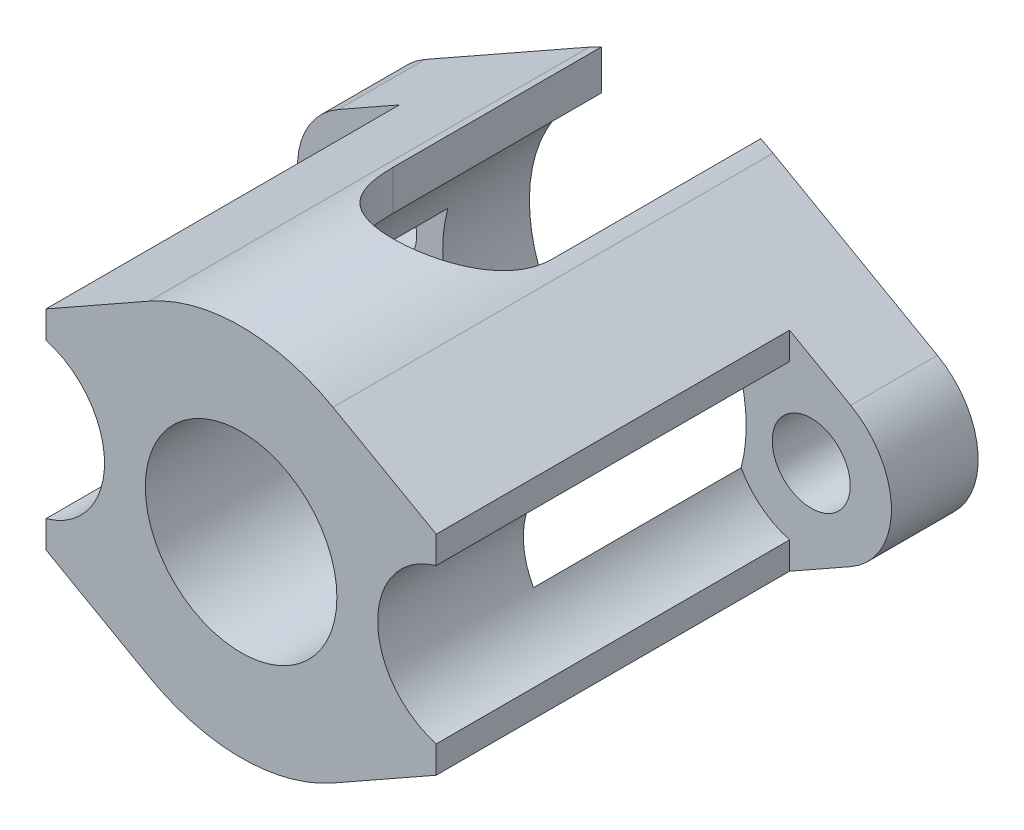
ISO-10303-21;
HEADER;
FILE_DESCRIPTION(('STEP AP214'),'2;1');
FILE_NAME('part.step','',(''),(''),'','','');
FILE_SCHEMA(('AUTOMOTIVE_DESIGN { 1 0 10303 214 1 1 1 1 }'));
ENDSEC;
DATA;
#1=APPLICATION_CONTEXT('core data for automotive mechanical design processes');
#2=APPLICATION_PROTOCOL_DEFINITION('international standard','automotive_design',2000,#1);
#3=PRODUCT_CONTEXT('',#1,'mechanical');
#4=PRODUCT('Part','Part','',(#3));
#5=PRODUCT_RELATED_PRODUCT_CATEGORY('part','',(#4));
#6=PRODUCT_DEFINITION_FORMATION('','',#4);
#7=PRODUCT_DEFINITION_CONTEXT('part definition',#1,'design');
#8=PRODUCT_DEFINITION('design','',#6,#7);
#9=PRODUCT_DEFINITION_SHAPE('','',#8);
#10=(LENGTH_UNIT() NAMED_UNIT(*) SI_UNIT(.MILLI.,.METRE.));
#11=(NAMED_UNIT(*) PLANE_ANGLE_UNIT() SI_UNIT($,.RADIAN.));
#12=(NAMED_UNIT(*) SI_UNIT($,.STERADIAN.) SOLID_ANGLE_UNIT());
#13=UNCERTAINTY_MEASURE_WITH_UNIT(LENGTH_MEASURE(1.E-05),#10,'distance_accuracy_value','');
#14=(GEOMETRIC_REPRESENTATION_CONTEXT(3) GLOBAL_UNCERTAINTY_ASSIGNED_CONTEXT((#13)) GLOBAL_UNIT_ASSIGNED_CONTEXT((#10,
#11,#12)) REPRESENTATION_CONTEXT('',''));
#15=CARTESIAN_POINT('',(0.,0.,0.));
#16=DIRECTION('',(0.,0.,1.));
#17=DIRECTION('',(1.,0.,0.));
#18=AXIS2_PLACEMENT_3D('',#15,#16,#17);
#19=CARTESIAN_POINT('',(12.7,0.,25.781));
#20=DIRECTION('',(0.,0.,-1.));
#21=DIRECTION('',(-1.,0.,0.));
#22=AXIS2_PLACEMENT_3D('',#19,#20,#21);
#23=CYLINDRICAL_SURFACE('',#22,4.699);
#24=CARTESIAN_POINT('',(12.7,0.,5.08));
#25=DIRECTION('',(0.,0.,1.));
#26=DIRECTION('',(1.,0.,0.));
#27=AXIS2_PLACEMENT_3D('',#24,#25,#26);
#28=CIRCLE('',#27,4.699);
#29=CARTESIAN_POINT('',(15.011908,-4.09092683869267,5.08));
#30=VERTEX_POINT('',#29);
#31=CARTESIAN_POINT('',(15.011908,4.09092683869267,5.08));
#32=VERTEX_POINT('',#31);
#33=EDGE_CURVE('E262',#30,#32,#28,.T.);
#34=ORIENTED_EDGE('',*,*,#33,.F.);
#35=DIRECTION('',(0.,0.,-1.));
#36=VECTOR('',#35,1.);
#37=CARTESIAN_POINT('',(15.011908,-4.09092683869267,25.781));
#38=LINE('',#37,#36);
#39=CARTESIAN_POINT('',(15.011908,-4.09092683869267,0.));
#40=VERTEX_POINT('',#39);
#41=EDGE_CURVE('E417',#30,#40,#38,.T.);
#42=ORIENTED_EDGE('',*,*,#41,.T.);
#43=CARTESIAN_POINT('',(12.7,0.,0.));
#44=DIRECTION('',(0.,0.,1.));
#45=DIRECTION('',(1.,0.,0.));
#46=AXIS2_PLACEMENT_3D('',#43,#44,#45);
#47=CIRCLE('',#46,4.699);
#48=CARTESIAN_POINT('',(15.011908,4.09092683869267,0.));
#49=VERTEX_POINT('',#48);
#50=EDGE_CURVE('E483',#40,#49,#47,.T.);
#51=ORIENTED_EDGE('',*,*,#50,.T.);
#52=DIRECTION('',(0.,0.,-1.));
#53=VECTOR('',#52,1.);
#54=CARTESIAN_POINT('',(15.011908,4.09092683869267,25.781));
#55=LINE('',#54,#53);
#56=EDGE_CURVE('E419',#32,#49,#55,.T.);
#57=ORIENTED_EDGE('',*,*,#56,.F.);
#58=EDGE_LOOP('',(#34,#42,#51,#57));
#59=FACE_BOUND('',#58,.T.);
#60=ADVANCED_FACE('F38',(#59),#23,.T.);
#61=CARTESIAN_POINT('',(12.7,0.,25.781));
#62=DIRECTION('',(0.,0.,-1.));
#63=DIRECTION('',(-1.,0.,0.));
#64=AXIS2_PLACEMENT_3D('',#61,#62,#63);
#65=CYLINDRICAL_SURFACE('',#64,2.286);
#66=CARTESIAN_POINT('',(12.7,0.,0.));
#67=DIRECTION('',(0.,0.,1.));
#68=DIRECTION('',(1.,0.,0.));
#69=AXIS2_PLACEMENT_3D('',#66,#67,#68);
#70=CIRCLE('',#69,2.286);
#71=CARTESIAN_POINT('',(14.986,0.,0.));
#72=VERTEX_POINT('',#71);
#73=EDGE_CURVE('E508',#72,#72,#70,.T.);
#74=ORIENTED_EDGE('',*,*,#73,.F.);
#75=EDGE_LOOP('',(#74));
#76=FACE_BOUND('',#75,.T.);
#77=CARTESIAN_POINT('',(12.7,0.,5.08));
#78=DIRECTION('',(0.,0.,1.));
#79=DIRECTION('',(1.,0.,0.));
#80=AXIS2_PLACEMENT_3D('',#77,#78,#79);
#81=CIRCLE('',#80,2.286);
#82=CARTESIAN_POINT('',(14.986,0.,5.08));
#83=VERTEX_POINT('',#82);
#84=EDGE_CURVE('E257',#83,#83,#81,.T.);
#85=ORIENTED_EDGE('',*,*,#84,.T.);
#86=EDGE_LOOP('',(#85));
#87=FACE_BOUND('',#86,.T.);
#88=ADVANCED_FACE('F391',(#76,#87),#65,.F.);
#89=CARTESIAN_POINT('',(-12.7,0.,25.781));
#90=DIRECTION('',(0.,0.,-1.));
#91=DIRECTION('',(-1.,0.,0.));
#92=AXIS2_PLACEMENT_3D('',#89,#90,#91);
#93=CYLINDRICAL_SURFACE('',#92,4.699);
#94=CARTESIAN_POINT('',(-12.7,0.,5.08));
#95=DIRECTION('',(0.,0.,1.));
#96=DIRECTION('',(1.,0.,0.));
#97=AXIS2_PLACEMENT_3D('',#94,#95,#96);
#98=CIRCLE('',#97,4.699);
#99=CARTESIAN_POINT('',(-15.011908,4.09092683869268,5.08));
#100=VERTEX_POINT('',#99);
#101=CARTESIAN_POINT('',(-15.011908,-4.09092683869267,5.08));
#102=VERTEX_POINT('',#101);
#103=EDGE_CURVE('E298',#100,#102,#98,.T.);
#104=ORIENTED_EDGE('',*,*,#103,.F.);
#105=DIRECTION('',(0.,0.,-1.));
#106=VECTOR('',#105,1.);
#107=CARTESIAN_POINT('',(-15.011908,4.09092683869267,25.781));
#108=LINE('',#107,#106);
#109=CARTESIAN_POINT('',(-15.011908,4.09092683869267,0.));
#110=VERTEX_POINT('',#109);
#111=EDGE_CURVE('E440',#100,#110,#108,.T.);
#112=ORIENTED_EDGE('',*,*,#111,.T.);
#113=CARTESIAN_POINT('',(-12.7,0.,0.));
#114=DIRECTION('',(0.,0.,1.));
#115=DIRECTION('',(-1.,0.,0.));
#116=AXIS2_PLACEMENT_3D('',#113,#114,#115);
#117=CIRCLE('',#116,4.699);
#118=CARTESIAN_POINT('',(-15.011908,-4.09092683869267,0.));
#119=VERTEX_POINT('',#118);
#120=EDGE_CURVE('E488',#110,#119,#117,.T.);
#121=ORIENTED_EDGE('',*,*,#120,.T.);
#122=DIRECTION('',(0.,0.,-1.));
#123=VECTOR('',#122,1.);
#124=CARTESIAN_POINT('',(-15.011908,-4.09092683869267,25.781));
#125=LINE('',#124,#123);
#126=EDGE_CURVE('E438',#102,#119,#125,.T.);
#127=ORIENTED_EDGE('',*,*,#126,.F.);
#128=EDGE_LOOP('',(#104,#112,#121,#127));
#129=FACE_BOUND('',#128,.T.);
#130=ADVANCED_FACE('F385',(#129),#93,.T.);
#131=CARTESIAN_POINT('',(-12.7,0.,25.781));
#132=DIRECTION('',(0.,0.,-1.));
#133=DIRECTION('',(-1.,0.,0.));
#134=AXIS2_PLACEMENT_3D('',#131,#132,#133);
#135=CYLINDRICAL_SURFACE('',#134,2.286);
#136=CARTESIAN_POINT('',(-12.7,0.,0.));
#137=DIRECTION('',(0.,0.,1.));
#138=DIRECTION('',(-1.,0.,0.));
#139=AXIS2_PLACEMENT_3D('',#136,#137,#138);
#140=CIRCLE('',#139,2.286);
#141=CARTESIAN_POINT('',(-14.986,0.,0.));
#142=VERTEX_POINT('',#141);
#143=EDGE_CURVE('E452',#142,#142,#140,.T.);
#144=ORIENTED_EDGE('',*,*,#143,.F.);
#145=EDGE_LOOP('',(#144));
#146=FACE_BOUND('',#145,.T.);
#147=CARTESIAN_POINT('',(-12.7,0.,5.08));
#148=DIRECTION('',(0.,0.,1.));
#149=DIRECTION('',(1.,0.,0.));
#150=AXIS2_PLACEMENT_3D('',#147,#148,#149);
#151=CIRCLE('',#150,2.286);
#152=CARTESIAN_POINT('',(-10.414,0.,5.08));
#153=VERTEX_POINT('',#152);
#154=EDGE_CURVE('E293',#153,#153,#151,.T.);
#155=ORIENTED_EDGE('',*,*,#154,.T.);
#156=EDGE_LOOP('',(#155));
#157=FACE_BOUND('',#156,.T.);
#158=ADVANCED_FACE('F380',(#146,#157),#135,.F.);
#159=CARTESIAN_POINT('',(12.7,0.,0.));
#160=DIRECTION('',(0.,0.,1.));
#161=DIRECTION('',(1.,0.,0.));
#162=AXIS2_PLACEMENT_3D('',#159,#160,#161);
#163=PLANE('',#162);
#164=ORIENTED_EDGE('',*,*,#73,.T.);
#165=EDGE_LOOP('',(#164));
#166=FACE_BOUND('',#165,.T.);
#167=CARTESIAN_POINT('',(0.,0.,0.));
#168=DIRECTION('',(0.,0.,1.));
#169=DIRECTION('',(-1.,0.,0.));
#170=AXIS2_PLACEMENT_3D('',#167,#168,#169);
#171=CIRCLE('',#170,10.9474);
#172=CARTESIAN_POINT('',(4.6609,-9.90563364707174,0.));
#173=VERTEX_POINT('',#172);
#174=CARTESIAN_POINT('',(5.3861208,-9.53075387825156,0.));
#175=VERTEX_POINT('',#174);
#176=EDGE_CURVE('E492',#173,#175,#171,.T.);
#177=ORIENTED_EDGE('',*,*,#176,.F.);
#178=DIRECTION('',(0.,1.,0.));
#179=VECTOR('',#178,1.);
#180=CARTESIAN_POINT('',(4.6609,-10.9474,0.));
#181=LINE('',#180,#179);
#182=CARTESIAN_POINT('',(4.6609,-7.57021209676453,0.));
#183=VERTEX_POINT('',#182);
#184=EDGE_CURVE('E306',#173,#183,#181,.T.);
#185=ORIENTED_EDGE('',*,*,#184,.T.);
#186=CARTESIAN_POINT('',(0.,0.,0.));
#187=DIRECTION('',(0.,0.,-1.));
#188=DIRECTION('',(-1.,0.,0.));
#189=AXIS2_PLACEMENT_3D('',#186,#187,#188);
#190=CIRCLE('',#189,8.89);
#191=CARTESIAN_POINT('',(4.6609,7.57021209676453,0.));
#192=VERTEX_POINT('',#191);
#193=EDGE_CURVE('E527',#192,#183,#190,.T.);
#194=ORIENTED_EDGE('',*,*,#193,.F.);
#195=CARTESIAN_POINT('',(4.6609,9.90563364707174,0.));
#196=VERTEX_POINT('',#195);
#197=EDGE_CURVE('E303',#192,#196,#181,.T.);
#198=ORIENTED_EDGE('',*,*,#197,.T.);
#199=CARTESIAN_POINT('',(0.,0.,0.));
#200=DIRECTION('',(0.,0.,1.));
#201=DIRECTION('',(1.,0.,0.));
#202=AXIS2_PLACEMENT_3D('',#199,#200,#201);
#203=CIRCLE('',#202,10.9474);
#204=CARTESIAN_POINT('',(5.3861208,9.53075387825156,0.));
#205=VERTEX_POINT('',#204);
#206=EDGE_CURVE('E479',#205,#196,#203,.T.);
#207=ORIENTED_EDGE('',*,*,#206,.F.);
#208=DIRECTION('',(-0.870595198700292,0.491999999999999,0.));
#209=VECTOR('',#208,1.);
#210=CARTESIAN_POINT('',(5.3861208,9.53075387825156,0.));
#211=LINE('',#210,#209);
#212=EDGE_CURVE('E480',#49,#205,#211,.T.);
#213=ORIENTED_EDGE('',*,*,#212,.F.);
#214=ORIENTED_EDGE('',*,*,#50,.F.);
#215=DIRECTION('',(0.870595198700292,0.491999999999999,0.));
#216=VECTOR('',#215,1.);
#217=CARTESIAN_POINT('',(5.3861208,-9.53075387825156,0.));
#218=LINE('',#217,#216);
#219=EDGE_CURVE('E424',#175,#40,#218,.T.);
#220=ORIENTED_EDGE('',*,*,#219,.F.);
#221=EDGE_LOOP('',(#177,#185,#194,#198,#207,#213,#214,#220));
#222=FACE_BOUND('',#221,.T.);
#223=ADVANCED_FACE('F384',(#166,#222),#163,.F.);
#224=CARTESIAN_POINT('',(0.,0.,25.781));
#225=DIRECTION('',(0.,0.,-1.));
#226=DIRECTION('',(-1.,0.,0.));
#227=AXIS2_PLACEMENT_3D('',#224,#225,#226);
#228=CYLINDRICAL_SURFACE('',#227,5.6134);
#229=CARTESIAN_POINT('',(0.,0.,25.781));
#230=DIRECTION('',(0.,0.,1.));
#231=DIRECTION('',(1.,0.,0.));
#232=AXIS2_PLACEMENT_3D('',#229,#230,#231);
#233=CIRCLE('',#232,5.6134);
#234=CARTESIAN_POINT('',(5.6134,0.,25.781));
#235=VERTEX_POINT('',#234);
#236=EDGE_CURVE('E510',#235,#235,#233,.T.);
#237=ORIENTED_EDGE('',*,*,#236,.T.);
#238=EDGE_LOOP('',(#237));
#239=FACE_BOUND('',#238,.T.);
#240=CARTESIAN_POINT('',(0.,0.,17.2466));
#241=DIRECTION('',(0.,0.,-1.));
#242=DIRECTION('',(-1.,0.,0.));
#243=AXIS2_PLACEMENT_3D('',#240,#241,#242);
#244=CIRCLE('',#243,5.6134);
#245=CARTESIAN_POINT('',(-5.6134,0.,17.2466));
#246=VERTEX_POINT('',#245);
#247=EDGE_CURVE('E450',#246,#246,#244,.T.);
#248=ORIENTED_EDGE('',*,*,#247,.T.);
#249=EDGE_LOOP('',(#248));
#250=FACE_BOUND('',#249,.T.);
#251=ADVANCED_FACE('F387',(#239,#250),#228,.F.);
#252=CARTESIAN_POINT('',(12.7,0.,25.781));
#253=DIRECTION('',(0.,0.,1.));
#254=DIRECTION('',(1.,0.,0.));
#255=AXIS2_PLACEMENT_3D('',#252,#253,#254);
#256=PLANE('',#255);
#257=DIRECTION('',(0.,-1.,0.));
#258=VECTOR('',#257,1.);
#259=CARTESIAN_POINT('',(11.43,-9.35955574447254,25.781));
#260=LINE('',#259,#258);
#261=CARTESIAN_POINT('',(11.43,-4.52412433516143,25.781));
#262=VERTEX_POINT('',#261);
#263=CARTESIAN_POINT('',(11.43,-6.11517270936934,25.781));
#264=VERTEX_POINT('',#263);
#265=EDGE_CURVE('E241',#262,#264,#260,.T.);
#266=ORIENTED_EDGE('',*,*,#265,.F.);
#267=CARTESIAN_POINT('',(12.7,0.,25.781));
#268=DIRECTION('',(0.,0.,1.));
#269=DIRECTION('',(-1.,0.,0.));
#270=AXIS2_PLACEMENT_3D('',#267,#268,#269);
#271=CIRCLE('',#270,4.69899999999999);
#272=CARTESIAN_POINT('',(11.43,4.52412433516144,25.781));
#273=VERTEX_POINT('',#272);
#274=EDGE_CURVE('E232',#273,#262,#271,.T.);
#275=ORIENTED_EDGE('',*,*,#274,.F.);
#276=DIRECTION('',(0.,-1.,0.));
#277=VECTOR('',#276,1.);
#278=CARTESIAN_POINT('',(11.43,4.52412433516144,25.781));
#279=LINE('',#278,#277);
#280=CARTESIAN_POINT('',(11.43,6.11517270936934,25.781));
#281=VERTEX_POINT('',#280);
#282=EDGE_CURVE('E223',#281,#273,#279,.T.);
#283=ORIENTED_EDGE('',*,*,#282,.F.);
#284=DIRECTION('',(-0.870595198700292,0.491999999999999,0.));
#285=VECTOR('',#284,1.);
#286=CARTESIAN_POINT('',(5.3861208,9.53075387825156,25.781));
#287=LINE('',#286,#285);
#288=CARTESIAN_POINT('',(5.3861208,9.53075387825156,25.781));
#289=VERTEX_POINT('',#288);
#290=EDGE_CURVE('E496',#281,#289,#287,.T.);
#291=ORIENTED_EDGE('',*,*,#290,.T.);
#292=CARTESIAN_POINT('',(0.,0.,25.781));
#293=DIRECTION('',(0.,0.,1.));
#294=DIRECTION('',(1.,0.,0.));
#295=AXIS2_PLACEMENT_3D('',#292,#293,#294);
#296=CIRCLE('',#295,10.9474);
#297=CARTESIAN_POINT('',(-5.3861208,9.53075387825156,25.781));
#298=VERTEX_POINT('',#297);
#299=EDGE_CURVE('E519',#289,#298,#296,.T.);
#300=ORIENTED_EDGE('',*,*,#299,.T.);
#301=DIRECTION('',(-0.870595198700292,-0.491999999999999,0.));
#302=VECTOR('',#301,1.);
#303=CARTESIAN_POINT('',(-5.3861208,9.53075387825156,25.781));
#304=LINE('',#303,#302);
#305=CARTESIAN_POINT('',(-11.43,6.11517270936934,25.781));
#306=VERTEX_POINT('',#305);
#307=EDGE_CURVE('E516',#298,#306,#304,.T.);
#308=ORIENTED_EDGE('',*,*,#307,.T.);
#309=DIRECTION('',(0.,1.,0.));
#310=VECTOR('',#309,1.);
#311=CARTESIAN_POINT('',(-11.43,4.52412433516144,25.781));
#312=LINE('',#311,#310);
#313=CARTESIAN_POINT('',(-11.43,4.52412433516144,25.781));
#314=VERTEX_POINT('',#313);
#315=EDGE_CURVE('E278',#314,#306,#312,.T.);
#316=ORIENTED_EDGE('',*,*,#315,.F.);
#317=CARTESIAN_POINT('',(-12.7,0.,25.781));
#318=DIRECTION('',(0.,0.,1.));
#319=DIRECTION('',(1.,0.,0.));
#320=AXIS2_PLACEMENT_3D('',#317,#318,#319);
#321=CIRCLE('',#320,4.69899999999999);
#322=CARTESIAN_POINT('',(-11.43,-4.52412433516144,25.781));
#323=VERTEX_POINT('',#322);
#324=EDGE_CURVE('E266',#323,#314,#321,.T.);
#325=ORIENTED_EDGE('',*,*,#324,.F.);
#326=DIRECTION('',(0.,1.,0.));
#327=VECTOR('',#326,1.);
#328=CARTESIAN_POINT('',(-11.43,-9.35955574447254,25.781));
#329=LINE('',#328,#327);
#330=CARTESIAN_POINT('',(-11.43,-6.11517270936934,25.781));
#331=VERTEX_POINT('',#330);
#332=EDGE_CURVE('E280',#331,#323,#329,.T.);
#333=ORIENTED_EDGE('',*,*,#332,.F.);
#334=DIRECTION('',(0.870595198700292,-0.491999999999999,0.));
#335=VECTOR('',#334,1.);
#336=CARTESIAN_POINT('',(-5.38612079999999,-9.53075387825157,25.781));
#337=LINE('',#336,#335);
#338=CARTESIAN_POINT('',(-5.38612079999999,-9.53075387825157,25.781));
#339=VERTEX_POINT('',#338);
#340=EDGE_CURVE('E514',#331,#339,#337,.T.);
#341=ORIENTED_EDGE('',*,*,#340,.T.);
#342=CARTESIAN_POINT('',(0.,0.,25.781));
#343=DIRECTION('',(0.,0.,1.));
#344=DIRECTION('',(-1.,0.,0.));
#345=AXIS2_PLACEMENT_3D('',#342,#343,#344);
#346=CIRCLE('',#345,10.9474);
#347=CARTESIAN_POINT('',(5.3861208,-9.53075387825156,25.781));
#348=VERTEX_POINT('',#347);
#349=EDGE_CURVE('E431',#339,#348,#346,.T.);
#350=ORIENTED_EDGE('',*,*,#349,.T.);
#351=DIRECTION('',(0.870595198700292,0.491999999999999,0.));
#352=VECTOR('',#351,1.);
#353=CARTESIAN_POINT('',(5.3861208,-9.53075387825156,25.781));
#354=LINE('',#353,#352);
#355=EDGE_CURVE('E427',#348,#264,#354,.T.);
#356=ORIENTED_EDGE('',*,*,#355,.T.);
#357=EDGE_LOOP('',(#266,#275,#283,#291,#300,#308,#316,#325,#333,#341,#350,#356));
#358=FACE_BOUND('',#357,.T.);
#359=ORIENTED_EDGE('',*,*,#236,.F.);
#360=EDGE_LOOP('',(#359));
#361=FACE_BOUND('',#360,.T.);
#362=ADVANCED_FACE('F243',(#358,#361),#256,.T.);
#363=CARTESIAN_POINT('',(-4.6609,9.90563364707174,0.));
#364=VERTEX_POINT('',#363);
#365=CARTESIAN_POINT('',(-5.3861208,9.53075387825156,0.));
#366=VERTEX_POINT('',#365);
#367=EDGE_CURVE('E473',#364,#366,#203,.T.);
#368=ORIENTED_EDGE('',*,*,#367,.F.);
#369=DIRECTION('',(0.,1.,0.));
#370=VECTOR('',#369,1.);
#371=CARTESIAN_POINT('',(-4.6609,-10.9474,0.));
#372=LINE('',#371,#370);
#373=CARTESIAN_POINT('',(-4.6609,7.57021209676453,0.));
#374=VERTEX_POINT('',#373);
#375=EDGE_CURVE('E302',#374,#364,#372,.T.);
#376=ORIENTED_EDGE('',*,*,#375,.F.);
#377=CARTESIAN_POINT('',(-4.6609,-7.57021209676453,0.));
#378=VERTEX_POINT('',#377);
#379=EDGE_CURVE('E465',#378,#374,#190,.T.);
#380=ORIENTED_EDGE('',*,*,#379,.F.);
#381=CARTESIAN_POINT('',(-4.6609,-9.90563364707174,0.));
#382=VERTEX_POINT('',#381);
#383=EDGE_CURVE('E315',#382,#378,#372,.T.);
#384=ORIENTED_EDGE('',*,*,#383,.F.);
#385=CARTESIAN_POINT('',(-5.38612079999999,-9.53075387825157,0.));
#386=VERTEX_POINT('',#385);
#387=EDGE_CURVE('E493',#386,#382,#171,.T.);
#388=ORIENTED_EDGE('',*,*,#387,.F.);
#389=DIRECTION('',(0.870595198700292,-0.491999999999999,0.));
#390=VECTOR('',#389,1.);
#391=CARTESIAN_POINT('',(-5.38612079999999,-9.53075387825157,0.));
#392=LINE('',#391,#390);
#393=EDGE_CURVE('E491',#119,#386,#392,.T.);
#394=ORIENTED_EDGE('',*,*,#393,.F.);
#395=ORIENTED_EDGE('',*,*,#120,.F.);
#396=DIRECTION('',(-0.870595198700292,-0.491999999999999,0.));
#397=VECTOR('',#396,1.);
#398=CARTESIAN_POINT('',(-5.3861208,9.53075387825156,0.));
#399=LINE('',#398,#397);
#400=EDGE_CURVE('E476',#366,#110,#399,.T.);
#401=ORIENTED_EDGE('',*,*,#400,.F.);
#402=EDGE_LOOP('',(#368,#376,#380,#384,#388,#394,#395,#401));
#403=FACE_BOUND('',#402,.T.);
#404=ORIENTED_EDGE('',*,*,#143,.T.);
#405=EDGE_LOOP('',(#404));
#406=FACE_BOUND('',#405,.T.);
#407=ADVANCED_FACE('F397',(#403,#406),#163,.F.);
#408=CARTESIAN_POINT('',(5.3861208,9.53075387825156,25.781));
#409=DIRECTION('',(-0.491999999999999,-0.870595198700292,0.));
#410=DIRECTION('',(0.870595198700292,-0.491999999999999,0.));
#411=AXIS2_PLACEMENT_3D('',#408,#409,#410);
#412=PLANE('',#411);
#413=ORIENTED_EDGE('',*,*,#290,.F.);
#414=DIRECTION('',(0.,0.,-1.));
#415=VECTOR('',#414,1.);
#416=CARTESIAN_POINT('',(11.43,6.11517270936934,25.781));
#417=LINE('',#416,#415);
#418=CARTESIAN_POINT('',(11.43,6.11517270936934,5.08));
#419=VERTEX_POINT('',#418);
#420=EDGE_CURVE('E13',#281,#419,#417,.T.);
#421=ORIENTED_EDGE('',*,*,#420,.T.);
#422=DIRECTION('',(-0.870595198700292,0.491999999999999,0.));
#423=VECTOR('',#422,1.);
#424=CARTESIAN_POINT('',(5.3861208,9.53075387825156,5.08));
#425=LINE('',#424,#423);
#426=EDGE_CURVE('E264',#32,#419,#425,.T.);
#427=ORIENTED_EDGE('',*,*,#426,.F.);
#428=ORIENTED_EDGE('',*,*,#56,.T.);
#429=ORIENTED_EDGE('',*,*,#212,.T.);
#430=DIRECTION('',(0.,0.,-1.));
#431=VECTOR('',#430,1.);
#432=CARTESIAN_POINT('',(5.3861208,9.53075387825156,25.781));
#433=LINE('',#432,#431);
#434=EDGE_CURVE('E445',#289,#205,#433,.T.);
#435=ORIENTED_EDGE('',*,*,#434,.F.);
#436=EDGE_LOOP('',(#413,#421,#427,#428,#429,#435));
#437=FACE_BOUND('',#436,.T.);
#438=ADVANCED_FACE('F399',(#437),#412,.F.);
#439=CARTESIAN_POINT('',(0.,0.,25.781));
#440=DIRECTION('',(0.,0.,-1.));
#441=DIRECTION('',(-1.,0.,0.));
#442=AXIS2_PLACEMENT_3D('',#439,#440,#441);
#443=CYLINDRICAL_SURFACE('',#442,10.9474);
#444=ORIENTED_EDGE('',*,*,#206,.T.);
#445=DIRECTION('',(0.,0.,-1.));
#446=VECTOR('',#445,1.);
#447=CARTESIAN_POINT('',(4.6609,9.90563364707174,25.781));
#448=LINE('',#447,#446);
#449=CARTESIAN_POINT('',(4.6609,9.90563364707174,12.2301));
#450=VERTEX_POINT('',#449);
#451=EDGE_CURVE('E528',#196,#450,#448,.F.);
#452=ORIENTED_EDGE('',*,*,#451,.T.);
#453=CARTESIAN_POINT('',(4.6609,9.90563364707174,12.2301));
#454=CARTESIAN_POINT('',(4.66091941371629,9.90560553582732,12.3547135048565));
#455=CARTESIAN_POINT('',(4.65590308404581,9.90798442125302,12.4793116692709));
#456=CARTESIAN_POINT('',(4.63595082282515,9.91734578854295,12.7274847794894));
#457=CARTESIAN_POINT('',(4.62101917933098,9.92432628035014,12.8510601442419));
#458=CARTESIAN_POINT('',(4.58147420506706,9.94264084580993,13.095770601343));
#459=CARTESIAN_POINT('',(4.55690330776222,9.95395583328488,13.2169139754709));
#460=CARTESIAN_POINT('',(4.49836655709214,9.98054578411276,13.4564382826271));
#461=CARTESIAN_POINT('',(4.46440002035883,9.99582103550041,13.5748190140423));
#462=CARTESIAN_POINT('',(4.34897973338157,10.0468443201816,13.9243207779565));
#463=CARTESIAN_POINT('',(4.25391596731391,10.0878339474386,14.1503449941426));
#464=CARTESIAN_POINT('',(4.03059536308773,10.1791130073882,14.5833579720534));
#465=CARTESIAN_POINT('',(3.90230220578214,10.2294125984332,14.7903255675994));
#466=CARTESIAN_POINT('',(3.60739674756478,10.3372294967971,15.192607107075));
#467=CARTESIAN_POINT('',(3.43898422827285,10.3949967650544,15.3865347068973));
#468=CARTESIAN_POINT('',(3.07227149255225,10.509208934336,15.7444601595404));
#469=CARTESIAN_POINT('',(2.87396473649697,10.5656535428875,15.9084514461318));
#470=CARTESIAN_POINT('',(2.55269024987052,10.646236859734,16.1321372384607));
#471=CARTESIAN_POINT('',(2.43885222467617,10.6729529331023,16.2042933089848));
#472=CARTESIAN_POINT('',(2.2049194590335,10.7237209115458,16.3386871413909));
#473=CARTESIAN_POINT('',(2.08482731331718,10.7477739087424,16.4009289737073));
#474=CARTESIAN_POINT('',(1.83915982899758,10.7925276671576,16.5149365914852));
#475=CARTESIAN_POINT('',(1.71358406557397,10.8132281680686,16.5667015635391));
#476=CARTESIAN_POINT('',(1.45792017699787,10.8506548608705,16.659199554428));
#477=CARTESIAN_POINT('',(1.32783436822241,10.8673830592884,16.6999381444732));
#478=CARTESIAN_POINT('',(1.07120297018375,10.8955886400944,16.7680711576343));
#479=CARTESIAN_POINT('',(0.94484181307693,10.9072995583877,16.7960641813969));
#480=CARTESIAN_POINT('',(0.689961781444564,10.9263827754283,16.8414650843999));
#481=CARTESIAN_POINT('',(0.561443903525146,10.933757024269,16.8588777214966));
#482=CARTESIAN_POINT('',(0.303241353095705,10.9439619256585,16.8829317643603));
#483=CARTESIAN_POINT('',(0.173556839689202,10.9467931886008,16.8895746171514));
#484=CARTESIAN_POINT('',(-0.0859301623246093,10.9478314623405,16.8920135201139));
#485=CARTESIAN_POINT('',(-0.215732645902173,10.94603866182,16.8878100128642));
#486=CARTESIAN_POINT('',(-0.466135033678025,10.9381426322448,16.8692216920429));
#487=CARTESIAN_POINT('',(-0.586793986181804,10.9323215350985,16.8555031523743));
#488=CARTESIAN_POINT('',(-0.826470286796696,10.9168192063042,16.8187426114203));
#489=CARTESIAN_POINT('',(-0.945487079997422,10.9071367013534,16.7956975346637));
#490=CARTESIAN_POINT('',(-1.18099623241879,10.8841536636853,16.7405161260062));
#491=CARTESIAN_POINT('',(-1.29748945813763,10.8708543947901,16.7083829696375));
#492=CARTESIAN_POINT('',(-1.52726672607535,10.8409631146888,16.6353246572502));
#493=CARTESIAN_POINT('',(-1.64054952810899,10.8243698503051,16.5943961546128));
#494=CARTESIAN_POINT('',(-1.97784989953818,10.769674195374,16.4575627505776));
#495=CARTESIAN_POINT('',(-2.19592343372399,10.727002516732,16.3484099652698));
#496=CARTESIAN_POINT('',(-2.61111908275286,10.6335829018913,16.0985476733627));
#497=CARTESIAN_POINT('',(-2.80823340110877,10.5828319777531,15.9578264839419));
#498=CARTESIAN_POINT('',(-3.19136236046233,10.4739320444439,15.6368752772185));
#499=CARTESIAN_POINT('',(-3.37551360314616,10.4155134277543,15.4545097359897));
#500=CARTESIAN_POINT('',(-3.71152391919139,10.300571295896,15.0612541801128));
#501=CARTESIAN_POINT('',(-3.86336559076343,10.2440488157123,14.850348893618));
#502=CARTESIAN_POINT('',(-4.06617328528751,10.1645139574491,14.5122899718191));
#503=CARTESIAN_POINT('',(-4.13051587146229,10.1384669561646,14.3936849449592));
#504=CARTESIAN_POINT('',(-4.24887599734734,10.0894360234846,14.1508445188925));
#505=CARTESIAN_POINT('',(-4.30289804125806,10.0664507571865,14.0266116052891));
#506=CARTESIAN_POINT('',(-4.40002650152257,10.0243772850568,13.7735075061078));
#507=CARTESIAN_POINT('',(-4.44314756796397,10.0052838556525,13.6446428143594));
#508=CARTESIAN_POINT('',(-4.51807345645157,9.97167248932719,13.3831383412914));
#509=CARTESIAN_POINT('',(-4.54988331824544,9.95715251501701,13.2505002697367));
#510=CARTESIAN_POINT('',(-4.60403341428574,9.93224394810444,12.9709199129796));
#511=CARTESIAN_POINT('',(-4.62532098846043,9.92231937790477,12.8237301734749));
#512=CARTESIAN_POINT('',(-4.65377396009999,9.90898577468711,12.527734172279));
#513=CARTESIAN_POINT('',(-4.66094213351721,9.90557546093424,12.3789282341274));
#514=CARTESIAN_POINT('',(-4.6609,9.90563364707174,12.2301));
#515=B_SPLINE_CURVE_WITH_KNOTS('',3,(#453,#454,#455,#456,#457,#458,#459,#460,#461,#462,#463,
#464,#465,#466,#467,#468,#469,#470,#471,#472,#473,#474,#475,#476,#477,#478,#479,#480,#481,#482,
#483,#484,#485,#486,#487,#488,#489,#490,#491,#492,#493,#494,#495,#496,#497,#498,#499,#500,#501,
#502,#503,#504,#505,#506,#507,#508,#509,#510,#511,#512,#513,#514),.UNSPECIFIED.,.F.,.F.,(4,2,2,
2,2,2,2,2,2,2,2,2,2,2,2,2,2,2,2,2,2,2,2,2,2,2,2,2,2,2,4),(0.,0.373691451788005,
0.747221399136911,1.11912513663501,1.49105593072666,2.23328037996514,2.9763195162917,
3.76274996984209,4.54935271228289,4.96112017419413,5.37271814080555,5.78434805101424,
6.19576959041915,6.58512089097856,6.97429697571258,7.36342076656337,7.752528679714,
8.11682615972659,8.4812438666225,8.84553439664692,9.20996378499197,9.94921716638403,
10.6887445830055,11.4823075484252,12.2762968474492,12.6881248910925,13.099772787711,
13.5108644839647,13.9217727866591,14.3681018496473,14.8143431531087),.UNSPECIFIED.);
#516=CARTESIAN_POINT('',(-4.6609,9.90563364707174,12.2301));
#517=VERTEX_POINT('',#516);
#518=EDGE_CURVE('E330',#450,#517,#515,.T.);
#519=ORIENTED_EDGE('',*,*,#518,.T.);
#520=DIRECTION('',(0.,0.,-1.));
#521=VECTOR('',#520,1.);
#522=CARTESIAN_POINT('',(-4.6609,9.90563364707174,25.781));
#523=LINE('',#522,#521);
#524=EDGE_CURVE('E320',#517,#364,#523,.T.);
#525=ORIENTED_EDGE('',*,*,#524,.T.);
#526=ORIENTED_EDGE('',*,*,#367,.T.);
#527=DIRECTION('',(0.,0.,-1.));
#528=VECTOR('',#527,1.);
#529=CARTESIAN_POINT('',(-5.3861208,9.53075387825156,25.781));
#530=LINE('',#529,#528);
#531=EDGE_CURVE('E442',#298,#366,#530,.T.);
#532=ORIENTED_EDGE('',*,*,#531,.F.);
#533=ORIENTED_EDGE('',*,*,#299,.F.);
#534=ORIENTED_EDGE('',*,*,#434,.T.);
#535=EDGE_LOOP('',(#444,#452,#519,#525,#526,#532,#533,#534));
#536=FACE_BOUND('',#535,.T.);
#537=ADVANCED_FACE('F533',(#536),#443,.T.);
#538=CARTESIAN_POINT('',(-5.3861208,9.53075387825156,25.781));
#539=DIRECTION('',(0.491999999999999,-0.870595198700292,0.));
#540=DIRECTION('',(0.870595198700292,0.491999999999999,0.));
#541=AXIS2_PLACEMENT_3D('',#538,#539,#540);
#542=PLANE('',#541);
#543=DIRECTION('',(-0.870595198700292,-0.491999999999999,0.));
#544=VECTOR('',#543,1.);
#545=CARTESIAN_POINT('',(-5.3861208,9.53075387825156,5.08));
#546=LINE('',#545,#544);
#547=CARTESIAN_POINT('',(-11.43,6.11517270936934,5.08));
#548=VERTEX_POINT('',#547);
#549=EDGE_CURVE('E300',#548,#100,#546,.T.);
#550=ORIENTED_EDGE('',*,*,#549,.F.);
#551=DIRECTION('',(0.,0.,1.));
#552=VECTOR('',#551,1.);
#553=CARTESIAN_POINT('',(-11.43,6.11517270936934,25.781));
#554=LINE('',#553,#552);
#555=EDGE_CURVE('E547',#548,#306,#554,.T.);
#556=ORIENTED_EDGE('',*,*,#555,.T.);
#557=ORIENTED_EDGE('',*,*,#307,.F.);
#558=ORIENTED_EDGE('',*,*,#531,.T.);
#559=ORIENTED_EDGE('',*,*,#400,.T.);
#560=ORIENTED_EDGE('',*,*,#111,.F.);
#561=EDGE_LOOP('',(#550,#556,#557,#558,#559,#560));
#562=FACE_BOUND('',#561,.T.);
#563=ADVANCED_FACE('F623',(#562),#542,.F.);
#564=CARTESIAN_POINT('',(-5.38612079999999,-9.53075387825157,25.781));
#565=DIRECTION('',(0.491999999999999,0.870595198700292,0.));
#566=DIRECTION('',(-0.870595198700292,0.491999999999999,0.));
#567=AXIS2_PLACEMENT_3D('',#564,#565,#566);
#568=PLANE('',#567);
#569=ORIENTED_EDGE('',*,*,#340,.F.);
#570=DIRECTION('',(0.,0.,-1.));
#571=VECTOR('',#570,1.);
#572=CARTESIAN_POINT('',(-11.43,-6.11517270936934,25.781));
#573=LINE('',#572,#571);
#574=CARTESIAN_POINT('',(-11.43,-6.11517270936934,5.08));
#575=VERTEX_POINT('',#574);
#576=EDGE_CURVE('E542',#331,#575,#573,.T.);
#577=ORIENTED_EDGE('',*,*,#576,.T.);
#578=DIRECTION('',(0.870595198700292,-0.491999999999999,0.));
#579=VECTOR('',#578,1.);
#580=CARTESIAN_POINT('',(-5.38612079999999,-9.53075387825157,5.08));
#581=LINE('',#580,#579);
#582=EDGE_CURVE('E296',#102,#575,#581,.T.);
#583=ORIENTED_EDGE('',*,*,#582,.F.);
#584=ORIENTED_EDGE('',*,*,#126,.T.);
#585=ORIENTED_EDGE('',*,*,#393,.T.);
#586=DIRECTION('',(0.,0.,-1.));
#587=VECTOR('',#586,1.);
#588=CARTESIAN_POINT('',(-5.38612079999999,-9.53075387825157,25.781));
#589=LINE('',#588,#587);
#590=EDGE_CURVE('E429',#339,#386,#589,.T.);
#591=ORIENTED_EDGE('',*,*,#590,.F.);
#592=EDGE_LOOP('',(#569,#577,#583,#584,#585,#591));
#593=FACE_BOUND('',#592,.T.);
#594=ADVANCED_FACE('F406',(#593),#568,.F.);
#595=CARTESIAN_POINT('',(0.,0.,25.781));
#596=DIRECTION('',(0.,0.,-1.));
#597=DIRECTION('',(-1.,0.,0.));
#598=AXIS2_PLACEMENT_3D('',#595,#596,#597);
#599=CYLINDRICAL_SURFACE('',#598,10.9474);
#600=DIRECTION('',(0.,0.,-1.));
#601=VECTOR('',#600,1.);
#602=CARTESIAN_POINT('',(-4.6609,-9.90563364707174,25.781));
#603=LINE('',#602,#601);
#604=CARTESIAN_POINT('',(-4.6609,-9.90563364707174,12.2301));
#605=VERTEX_POINT('',#604);
#606=EDGE_CURVE('E317',#382,#605,#603,.F.);
#607=ORIENTED_EDGE('',*,*,#606,.T.);
#608=CARTESIAN_POINT('',(-4.6609,-9.90563364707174,12.2301));
#609=CARTESIAN_POINT('',(-4.66091941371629,-9.90560553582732,12.3547135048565));
#610=CARTESIAN_POINT('',(-4.65590308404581,-9.90798442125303,12.4793116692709));
#611=CARTESIAN_POINT('',(-4.63595082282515,-9.91734578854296,12.7274847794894));
#612=CARTESIAN_POINT('',(-4.62101917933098,-9.92432628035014,12.8510601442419));
#613=CARTESIAN_POINT('',(-4.58147420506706,-9.94264084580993,13.095770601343));
#614=CARTESIAN_POINT('',(-4.55690330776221,-9.95395583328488,13.2169139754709));
#615=CARTESIAN_POINT('',(-4.49836655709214,-9.98054578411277,13.4564382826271));
#616=CARTESIAN_POINT('',(-4.46440002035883,-9.99582103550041,13.5748190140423));
#617=CARTESIAN_POINT('',(-4.34897973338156,-10.0468443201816,13.9243207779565));
#618=CARTESIAN_POINT('',(-4.25391596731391,-10.0878339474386,14.1503449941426));
#619=CARTESIAN_POINT('',(-4.03059536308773,-10.1791130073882,14.5833579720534));
#620=CARTESIAN_POINT('',(-3.90230220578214,-10.2294125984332,14.7903255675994));
#621=CARTESIAN_POINT('',(-3.60739674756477,-10.3372294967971,15.192607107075));
#622=CARTESIAN_POINT('',(-3.43898422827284,-10.3949967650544,15.3865347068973));
#623=CARTESIAN_POINT('',(-3.07227149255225,-10.509208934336,15.7444601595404));
#624=CARTESIAN_POINT('',(-2.87396473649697,-10.5656535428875,15.9084514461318));
#625=CARTESIAN_POINT('',(-2.55269024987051,-10.646236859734,16.1321372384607));
#626=CARTESIAN_POINT('',(-2.43885222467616,-10.6729529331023,16.2042933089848));
#627=CARTESIAN_POINT('',(-2.20491945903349,-10.7237209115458,16.3386871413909));
#628=CARTESIAN_POINT('',(-2.08482731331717,-10.7477739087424,16.4009289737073));
#629=CARTESIAN_POINT('',(-1.83915982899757,-10.7925276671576,16.5149365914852));
#630=CARTESIAN_POINT('',(-1.71358406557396,-10.8132281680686,16.5667015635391));
#631=CARTESIAN_POINT('',(-1.45792017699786,-10.8506548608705,16.659199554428));
#632=CARTESIAN_POINT('',(-1.3278343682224,-10.8673830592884,16.6999381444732));
#633=CARTESIAN_POINT('',(-1.07120297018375,-10.8955886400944,16.7680711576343));
#634=CARTESIAN_POINT('',(-0.944841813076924,-10.9072995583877,16.7960641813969));
#635=CARTESIAN_POINT('',(-0.689961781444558,-10.9263827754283,16.8414650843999));
#636=CARTESIAN_POINT('',(-0.56144390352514,-10.933757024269,16.8588777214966));
#637=CARTESIAN_POINT('',(-0.303241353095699,-10.9439619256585,16.8829317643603));
#638=CARTESIAN_POINT('',(-0.173556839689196,-10.9467931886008,16.8895746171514));
#639=CARTESIAN_POINT('',(0.085930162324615,-10.9478314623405,16.8920135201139));
#640=CARTESIAN_POINT('',(0.215732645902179,-10.94603866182,16.8878100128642));
#641=CARTESIAN_POINT('',(0.466135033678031,-10.9381426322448,16.8692216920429));
#642=CARTESIAN_POINT('',(0.586793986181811,-10.9323215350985,16.8555031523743));
#643=CARTESIAN_POINT('',(0.826470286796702,-10.9168192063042,16.8187426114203));
#644=CARTESIAN_POINT('',(0.945487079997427,-10.9071367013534,16.7956975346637));
#645=CARTESIAN_POINT('',(1.18099623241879,-10.8841536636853,16.7405161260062));
#646=CARTESIAN_POINT('',(1.29748945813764,-10.8708543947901,16.7083829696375));
#647=CARTESIAN_POINT('',(1.52726672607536,-10.8409631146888,16.6353246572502));
#648=CARTESIAN_POINT('',(1.640549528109,-10.8243698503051,16.5943961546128));
#649=CARTESIAN_POINT('',(1.97784989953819,-10.769674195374,16.4575627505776));
#650=CARTESIAN_POINT('',(2.19592343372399,-10.727002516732,16.3484099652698));
#651=CARTESIAN_POINT('',(2.61111908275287,-10.6335829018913,16.0985476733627));
#652=CARTESIAN_POINT('',(2.80823340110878,-10.5828319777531,15.9578264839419));
#653=CARTESIAN_POINT('',(3.19136236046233,-10.4739320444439,15.6368752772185));
#654=CARTESIAN_POINT('',(3.37551360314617,-10.4155134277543,15.4545097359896));
#655=CARTESIAN_POINT('',(3.71152391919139,-10.300571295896,15.0612541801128));
#656=CARTESIAN_POINT('',(3.86336559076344,-10.2440488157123,14.850348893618));
#657=CARTESIAN_POINT('',(4.06617328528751,-10.1645139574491,14.5122899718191));
#658=CARTESIAN_POINT('',(4.1305158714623,-10.1384669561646,14.3936849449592));
#659=CARTESIAN_POINT('',(4.24887599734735,-10.0894360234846,14.1508445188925));
#660=CARTESIAN_POINT('',(4.30289804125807,-10.0664507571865,14.0266116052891));
#661=CARTESIAN_POINT('',(4.40002650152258,-10.0243772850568,13.7735075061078));
#662=CARTESIAN_POINT('',(4.44314756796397,-10.0052838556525,13.6446428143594));
#663=CARTESIAN_POINT('',(4.51807345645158,-9.97167248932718,13.3831383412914));
#664=CARTESIAN_POINT('',(4.54988331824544,-9.95715251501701,13.2505002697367));
#665=CARTESIAN_POINT('',(4.60403341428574,-9.93224394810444,12.9709199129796));
#666=CARTESIAN_POINT('',(4.62532098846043,-9.92231937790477,12.8237301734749));
#667=CARTESIAN_POINT('',(4.65377396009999,-9.90898577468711,12.527734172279));
#668=CARTESIAN_POINT('',(4.66094213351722,-9.90557546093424,12.3789282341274));
#669=CARTESIAN_POINT('',(4.6609,-9.90563364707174,12.2301));
#670=B_SPLINE_CURVE_WITH_KNOTS('',3,(#608,#609,#610,#611,#612,#613,#614,#615,#616,#617,#618,
#619,#620,#621,#622,#623,#624,#625,#626,#627,#628,#629,#630,#631,#632,#633,#634,#635,#636,#637,
#638,#639,#640,#641,#642,#643,#644,#645,#646,#647,#648,#649,#650,#651,#652,#653,#654,#655,#656,
#657,#658,#659,#660,#661,#662,#663,#664,#665,#666,#667,#668,#669),.UNSPECIFIED.,.F.,.F.,(4,2,2,
2,2,2,2,2,2,2,2,2,2,2,2,2,2,2,2,2,2,2,2,2,2,2,2,2,2,2,4),(0.,0.373691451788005,
0.747221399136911,1.119125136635,1.49105593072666,2.23328037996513,2.9763195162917,
3.76274996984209,4.54935271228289,4.96112017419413,5.37271814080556,5.78434805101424,
6.19576959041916,6.58512089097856,6.97429697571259,7.36342076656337,7.752528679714,
8.11682615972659,8.4812438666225,8.84553439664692,9.20996378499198,9.94921716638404,
10.6887445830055,11.4823075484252,12.2762968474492,12.6881248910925,13.099772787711,
13.5108644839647,13.9217727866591,14.3681018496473,14.8143431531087),.UNSPECIFIED.);
#671=CARTESIAN_POINT('',(4.6609,-9.90563364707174,12.2301));
#672=VERTEX_POINT('',#671);
#673=EDGE_CURVE('E323',#605,#672,#670,.T.);
#674=ORIENTED_EDGE('',*,*,#673,.T.);
#675=DIRECTION('',(0.,0.,-1.));
#676=VECTOR('',#675,1.);
#677=CARTESIAN_POINT('',(4.6609,-9.90563364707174,25.781));
#678=LINE('',#677,#676);
#679=EDGE_CURVE('E503',#672,#173,#678,.T.);
#680=ORIENTED_EDGE('',*,*,#679,.T.);
#681=ORIENTED_EDGE('',*,*,#176,.T.);
#682=DIRECTION('',(0.,0.,-1.));
#683=VECTOR('',#682,1.);
#684=CARTESIAN_POINT('',(5.3861208,-9.53075387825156,25.781));
#685=LINE('',#684,#683);
#686=EDGE_CURVE('E426',#348,#175,#685,.T.);
#687=ORIENTED_EDGE('',*,*,#686,.F.);
#688=ORIENTED_EDGE('',*,*,#349,.F.);
#689=ORIENTED_EDGE('',*,*,#590,.T.);
#690=ORIENTED_EDGE('',*,*,#387,.T.);
#691=EDGE_LOOP('',(#607,#674,#680,#681,#687,#688,#689,#690));
#692=FACE_BOUND('',#691,.T.);
#693=ADVANCED_FACE('F336',(#692),#599,.T.);
#694=CARTESIAN_POINT('',(5.3861208,-9.53075387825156,25.781));
#695=DIRECTION('',(-0.491999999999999,0.870595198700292,0.));
#696=DIRECTION('',(-0.870595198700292,-0.491999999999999,0.));
#697=AXIS2_PLACEMENT_3D('',#694,#695,#696);
#698=PLANE('',#697);
#699=DIRECTION('',(0.870595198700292,0.491999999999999,0.));
#700=VECTOR('',#699,1.);
#701=CARTESIAN_POINT('',(5.3861208,-9.53075387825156,5.08));
#702=LINE('',#701,#700);
#703=CARTESIAN_POINT('',(11.43,-6.11517270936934,5.08));
#704=VERTEX_POINT('',#703);
#705=EDGE_CURVE('E260',#704,#30,#702,.T.);
#706=ORIENTED_EDGE('',*,*,#705,.F.);
#707=DIRECTION('',(0.,0.,1.));
#708=VECTOR('',#707,1.);
#709=CARTESIAN_POINT('',(11.43,-6.11517270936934,25.781));
#710=LINE('',#709,#708);
#711=EDGE_CURVE('E45',#704,#264,#710,.T.);
#712=ORIENTED_EDGE('',*,*,#711,.T.);
#713=ORIENTED_EDGE('',*,*,#355,.F.);
#714=ORIENTED_EDGE('',*,*,#686,.T.);
#715=ORIENTED_EDGE('',*,*,#219,.T.);
#716=ORIENTED_EDGE('',*,*,#41,.F.);
#717=EDGE_LOOP('',(#706,#712,#713,#714,#715,#716));
#718=FACE_BOUND('',#717,.T.);
#719=ADVANCED_FACE('F378',(#718),#698,.F.);
#720=CARTESIAN_POINT('',(0.,0.,17.2466));
#721=DIRECTION('',(0.,0.,-1.));
#722=DIRECTION('',(-1.,0.,0.));
#723=AXIS2_PLACEMENT_3D('',#720,#721,#722);
#724=CYLINDRICAL_SURFACE('',#723,8.89);
#725=CARTESIAN_POINT('',(0.,0.,17.2466));
#726=DIRECTION('',(0.,0.,-1.));
#727=DIRECTION('',(-1.,0.,0.));
#728=AXIS2_PLACEMENT_3D('',#725,#726,#727);
#729=CIRCLE('',#728,8.89);
#730=CARTESIAN_POINT('',(8.592185,-2.28176618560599,17.2466));
#731=VERTEX_POINT('',#730);
#732=CARTESIAN_POINT('',(-8.592185,-2.28176618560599,17.2466));
#733=VERTEX_POINT('',#732);
#734=EDGE_CURVE('E531',#731,#733,#729,.T.);
#735=ORIENTED_EDGE('',*,*,#734,.F.);
#736=DIRECTION('',(0.,0.,1.));
#737=VECTOR('',#736,1.);
#738=CARTESIAN_POINT('',(8.59218500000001,-2.28176618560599,11.1633));
#739=LINE('',#738,#737);
#740=CARTESIAN_POINT('',(8.592185,-2.28176618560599,5.08));
#741=VERTEX_POINT('',#740);
#742=EDGE_CURVE('E60',#731,#741,#739,.F.);
#743=ORIENTED_EDGE('',*,*,#742,.T.);
#744=CARTESIAN_POINT('',(0.,0.,5.08));
#745=DIRECTION('',(0.,0.,1.));
#746=DIRECTION('',(1.,0.,0.));
#747=AXIS2_PLACEMENT_3D('',#744,#745,#746);
#748=CIRCLE('',#747,8.89);
#749=CARTESIAN_POINT('',(8.592185,2.281766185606,5.08));
#750=VERTEX_POINT('',#749);
#751=EDGE_CURVE('E552',#750,#741,#748,.F.);
#752=ORIENTED_EDGE('',*,*,#751,.F.);
#753=DIRECTION('',(0.,0.,1.));
#754=VECTOR('',#753,1.);
#755=CARTESIAN_POINT('',(8.592185,2.281766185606,11.1633));
#756=LINE('',#755,#754);
#757=CARTESIAN_POINT('',(8.592185,2.281766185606,17.2466));
#758=VERTEX_POINT('',#757);
#759=EDGE_CURVE('E253',#750,#758,#756,.T.);
#760=ORIENTED_EDGE('',*,*,#759,.T.);
#761=CARTESIAN_POINT('',(-8.592185,2.281766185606,17.2466));
#762=VERTEX_POINT('',#761);
#763=EDGE_CURVE('E453',#762,#758,#729,.T.);
#764=ORIENTED_EDGE('',*,*,#763,.F.);
#765=DIRECTION('',(0.,0.,1.));
#766=VECTOR('',#765,1.);
#767=CARTESIAN_POINT('',(-8.592185,2.281766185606,15.4305));
#768=LINE('',#767,#766);
#769=CARTESIAN_POINT('',(-8.592185,2.281766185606,5.08));
#770=VERTEX_POINT('',#769);
#771=EDGE_CURVE('E290',#762,#770,#768,.F.);
#772=ORIENTED_EDGE('',*,*,#771,.T.);
#773=CARTESIAN_POINT('',(0.,0.,5.08));
#774=DIRECTION('',(0.,0.,1.));
#775=DIRECTION('',(1.,0.,0.));
#776=AXIS2_PLACEMENT_3D('',#773,#774,#775);
#777=CIRCLE('',#776,8.89);
#778=CARTESIAN_POINT('',(-8.592185,-2.28176618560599,5.08));
#779=VERTEX_POINT('',#778);
#780=EDGE_CURVE('E539',#779,#770,#777,.F.);
#781=ORIENTED_EDGE('',*,*,#780,.F.);
#782=DIRECTION('',(0.,0.,1.));
#783=VECTOR('',#782,1.);
#784=CARTESIAN_POINT('',(-8.59218500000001,-2.28176618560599,15.4305));
#785=LINE('',#784,#783);
#786=EDGE_CURVE('E287',#779,#733,#785,.T.);
#787=ORIENTED_EDGE('',*,*,#786,.T.);
#788=EDGE_LOOP('',(#735,#743,#752,#760,#764,#772,#781,#787));
#789=FACE_BOUND('',#788,.T.);
#790=CARTESIAN_POINT('',(-4.6609,7.57021209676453,12.2301));
#791=CARTESIAN_POINT('',(-4.66092296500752,7.57017323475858,12.3512288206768));
#792=CARTESIAN_POINT('',(-4.65617894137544,7.57311831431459,12.4723358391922));
#793=CARTESIAN_POINT('',(-4.63733796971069,7.58468308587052,12.71346649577));
#794=CARTESIAN_POINT('',(-4.62324745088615,7.59329887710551,12.8334908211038));
#795=CARTESIAN_POINT('',(-4.5860105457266,7.61584204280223,13.0708431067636));
#796=CARTESIAN_POINT('',(-4.56292117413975,7.62973596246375,13.1881832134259));
#797=CARTESIAN_POINT('',(-4.50800419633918,7.66231141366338,13.4201015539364));
#798=CARTESIAN_POINT('',(-4.4761754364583,7.68099357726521,13.5346794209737));
#799=CARTESIAN_POINT('',(-4.36828105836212,7.7431998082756,13.8726073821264));
#800=CARTESIAN_POINT('',(-4.27968003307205,7.79296578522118,14.0909446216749));
#801=CARTESIAN_POINT('',(-4.07206653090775,7.9034264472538,14.5098211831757));
#802=CARTESIAN_POINT('',(-3.95300198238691,7.96413979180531,14.7103292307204));
#803=CARTESIAN_POINT('',(-3.67529710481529,8.09629698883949,15.107617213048));
#804=CARTESIAN_POINT('',(-3.51405070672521,8.16821470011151,15.3024183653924));
#805=CARTESIAN_POINT('',(-3.16185027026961,8.31088558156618,15.6638020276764));
#806=CARTESIAN_POINT('',(-2.97088760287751,8.38163840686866,15.8303763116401));
#807=CARTESIAN_POINT('',(-2.65711664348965,8.48441228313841,16.0618590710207));
#808=CARTESIAN_POINT('',(-2.54350755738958,8.51924367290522,16.1382182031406));
#809=CARTESIAN_POINT('',(-2.30933045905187,8.58567851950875,16.2809967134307));
#810=CARTESIAN_POINT('',(-2.18876526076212,8.61728326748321,16.3474200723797));
#811=CARTESIAN_POINT('',(-1.94144188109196,8.67635108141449,16.4696539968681));
#812=CARTESIAN_POINT('',(-1.81468547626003,8.70381532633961,16.5254675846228));
#813=CARTESIAN_POINT('',(-1.55584967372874,8.75378739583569,16.6258455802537));
#814=CARTESIAN_POINT('',(-1.42377091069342,8.77629580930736,16.6704113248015));
#815=CARTESIAN_POINT('',(-1.16569595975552,8.81413253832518,16.7447164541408));
#816=CARTESIAN_POINT('',(-1.04001335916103,8.82987996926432,16.7753325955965));
#817=CARTESIAN_POINT('',(-0.786010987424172,8.85610417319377,16.8260702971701));
#818=CARTESIAN_POINT('',(-0.657691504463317,8.86658151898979,16.8461929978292));
#819=CARTESIAN_POINT('',(-0.399555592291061,8.88195725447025,16.8756582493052));
#820=CARTESIAN_POINT('',(-0.269739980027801,8.88685855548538,16.8850064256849));
#821=CARTESIAN_POINT('',(-0.00969563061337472,8.89094546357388,16.8928043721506));
#822=CARTESIAN_POINT('',(0.120533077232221,8.89013146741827,16.8912548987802));
#823=CARTESIAN_POINT('',(0.367801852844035,8.88316541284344,16.8779535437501));
#824=CARTESIAN_POINT('',(0.484911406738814,8.87753164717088,16.8671921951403));
#825=CARTESIAN_POINT('',(0.717719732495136,8.86174901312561,16.8369049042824));
#826=CARTESIAN_POINT('',(0.83341805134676,8.85159873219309,16.8173762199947));
#827=CARTESIAN_POINT('',(1.06254003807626,8.82702516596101,16.7697782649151));
#828=CARTESIAN_POINT('',(1.17596449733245,8.81260339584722,16.7417120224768));
#829=CARTESIAN_POINT('',(1.39988170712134,8.7798215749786,16.6773367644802));
#830=CARTESIAN_POINT('',(1.5103733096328,8.76146000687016,16.641024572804));
#831=CARTESIAN_POINT('',(1.83909531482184,8.70055872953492,16.5192324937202));
#832=CARTESIAN_POINT('',(2.05190063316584,8.652501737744,16.4214577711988));
#833=CARTESIAN_POINT('',(2.45844025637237,8.54590589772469,16.1967309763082));
#834=CARTESIAN_POINT('',(2.65216778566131,8.48736334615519,16.0697685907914));
#835=CARTESIAN_POINT('',(3.03613128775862,8.35817085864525,15.7755339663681));
#836=CARTESIAN_POINT('',(3.22403507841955,8.28689524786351,15.6054844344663));
#837=CARTESIAN_POINT('',(3.56998764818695,8.14385809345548,15.2372864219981));
#838=CARTESIAN_POINT('',(3.72800484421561,8.0720961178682,15.0391085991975));
#839=CARTESIAN_POINT('',(4.02154666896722,7.93018482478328,14.6018969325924));
#840=CARTESIAN_POINT('',(4.15447094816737,7.86056670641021,14.3609077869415));
#841=CARTESIAN_POINT('',(4.32114390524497,7.76941605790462,13.9824462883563));
#842=CARTESIAN_POINT('',(4.37122781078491,7.74125897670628,13.8535502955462));
#843=CARTESIAN_POINT('',(4.45998886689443,7.69046199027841,13.5908694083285));
#844=CARTESIAN_POINT('',(4.49867087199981,7.66781973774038,13.4570866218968));
#845=CARTESIAN_POINT('',(4.57400309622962,7.62319553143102,13.1442164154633));
#846=CARTESIAN_POINT('',(4.60644503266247,7.60351572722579,12.9637423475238));
#847=CARTESIAN_POINT('',(4.63903932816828,7.58363740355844,12.6903069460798));
#848=CARTESIAN_POINT('',(4.64722614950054,7.57861793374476,12.5985650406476));
#849=CARTESIAN_POINT('',(4.65815895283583,7.57190047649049,12.4145936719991));
#850=CARTESIAN_POINT('',(4.66090236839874,7.57020405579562,12.3223639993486));
#851=CARTESIAN_POINT('',(4.6609,7.57021209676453,12.2301));
#852=B_SPLINE_CURVE_WITH_KNOTS('',3,(#790,#791,#792,#793,#794,#795,#796,#797,#798,#799,#800,
#801,#802,#803,#804,#805,#806,#807,#808,#809,#810,#811,#812,#813,#814,#815,#816,#817,#818,#819,
#820,#821,#822,#823,#824,#825,#826,#827,#828,#829,#830,#831,#832,#833,#834,#835,#836,#837,#838,
#839,#840,#841,#842,#843,#844,#845,#846,#847,#848,#849,#850,#851),.UNSPECIFIED.,.F.,.F.,(4,2,2,
2,2,2,2,2,2,2,2,2,2,2,2,2,2,2,2,2,2,2,2,2,2,2,2,2,2,2,4),(0.,0.363222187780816,
0.726194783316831,1.08690410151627,1.44766105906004,2.16678412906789,2.88714471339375,
3.67268311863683,4.45845005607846,4.88172521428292,5.30483032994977,5.72781474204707,
6.15074886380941,6.54115117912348,6.93151105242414,7.32166701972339,7.71179590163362,
8.06459049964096,8.41749551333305,8.7702754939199,9.12319158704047,9.83716831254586,
10.551397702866,11.3378198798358,12.1250685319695,12.9717786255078,13.3945955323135,
13.8172321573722,14.3686111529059,14.6451497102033,14.9218186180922),.UNSPECIFIED.);
#853=CARTESIAN_POINT('',(-4.6609,7.57021209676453,12.2301));
#854=VERTEX_POINT('',#853);
#855=CARTESIAN_POINT('',(4.6609,7.57021209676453,12.2301));
#856=VERTEX_POINT('',#855);
#857=EDGE_CURVE('E363',#854,#856,#852,.T.);
#858=ORIENTED_EDGE('',*,*,#857,.T.);
#859=DIRECTION('',(0.,0.,-1.));
#860=VECTOR('',#859,1.);
#861=CARTESIAN_POINT('',(4.6609,7.57021209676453,17.2466));
#862=LINE('',#861,#860);
#863=EDGE_CURVE('E370',#856,#192,#862,.T.);
#864=ORIENTED_EDGE('',*,*,#863,.T.);
#865=ORIENTED_EDGE('',*,*,#193,.T.);
#866=DIRECTION('',(0.,0.,-1.));
#867=VECTOR('',#866,1.);
#868=CARTESIAN_POINT('',(4.6609,-7.57021209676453,17.2466));
#869=LINE('',#868,#867);
#870=CARTESIAN_POINT('',(4.6609,-7.57021209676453,12.2301));
#871=VERTEX_POINT('',#870);
#872=EDGE_CURVE('E459',#183,#871,#869,.F.);
#873=ORIENTED_EDGE('',*,*,#872,.T.);
#874=CARTESIAN_POINT('',(4.6609,-7.57021209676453,12.2301));
#875=CARTESIAN_POINT('',(4.66092296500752,-7.57017323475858,12.3512288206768));
#876=CARTESIAN_POINT('',(4.65617894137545,-7.57311831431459,12.4723358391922));
#877=CARTESIAN_POINT('',(4.6373379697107,-7.58468308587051,12.71346649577));
#878=CARTESIAN_POINT('',(4.62324745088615,-7.59329887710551,12.8334908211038));
#879=CARTESIAN_POINT('',(4.58601054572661,-7.61584204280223,13.0708431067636));
#880=CARTESIAN_POINT('',(4.56292117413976,-7.62973596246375,13.1881832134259));
#881=CARTESIAN_POINT('',(4.50800419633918,-7.66231141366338,13.4201015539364));
#882=CARTESIAN_POINT('',(4.4761754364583,-7.68099357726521,13.5346794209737));
#883=CARTESIAN_POINT('',(4.36828105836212,-7.7431998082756,13.8726073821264));
#884=CARTESIAN_POINT('',(4.27968003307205,-7.79296578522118,14.0909446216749));
#885=CARTESIAN_POINT('',(4.07206653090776,-7.9034264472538,14.5098211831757));
#886=CARTESIAN_POINT('',(3.95300198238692,-7.96413979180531,14.7103292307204));
#887=CARTESIAN_POINT('',(3.67529710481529,-8.09629698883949,15.107617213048));
#888=CARTESIAN_POINT('',(3.51405070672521,-8.16821470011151,15.3024183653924));
#889=CARTESIAN_POINT('',(3.16185027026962,-8.31088558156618,15.6638020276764));
#890=CARTESIAN_POINT('',(2.97088760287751,-8.38163840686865,15.8303763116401));
#891=CARTESIAN_POINT('',(2.65711664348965,-8.48441228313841,16.0618590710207));
#892=CARTESIAN_POINT('',(2.54350755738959,-8.51924367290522,16.1382182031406));
#893=CARTESIAN_POINT('',(2.30933045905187,-8.58567851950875,16.2809967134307));
#894=CARTESIAN_POINT('',(2.18876526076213,-8.6172832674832,16.3474200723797));
#895=CARTESIAN_POINT('',(1.94144188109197,-8.67635108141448,16.4696539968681));
#896=CARTESIAN_POINT('',(1.81468547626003,-8.7038153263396,16.5254675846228));
#897=CARTESIAN_POINT('',(1.55584967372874,-8.75378739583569,16.6258455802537));
#898=CARTESIAN_POINT('',(1.42377091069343,-8.77629580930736,16.6704113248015));
#899=CARTESIAN_POINT('',(1.16569595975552,-8.81413253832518,16.7447164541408));
#900=CARTESIAN_POINT('',(1.04001335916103,-8.82987996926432,16.7753325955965));
#901=CARTESIAN_POINT('',(0.786010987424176,-8.85610417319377,16.8260702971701));
#902=CARTESIAN_POINT('',(0.657691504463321,-8.86658151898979,16.8461929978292));
#903=CARTESIAN_POINT('',(0.399555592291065,-8.88195725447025,16.8756582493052));
#904=CARTESIAN_POINT('',(0.269739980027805,-8.88685855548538,16.8850064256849));
#905=CARTESIAN_POINT('',(0.00969563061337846,-8.89094546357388,16.8928043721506));
#906=CARTESIAN_POINT('',(-0.120533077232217,-8.89013146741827,16.8912548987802));
#907=CARTESIAN_POINT('',(-0.367801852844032,-8.88316541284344,16.8779535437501));
#908=CARTESIAN_POINT('',(-0.484911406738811,-8.87753164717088,16.8671921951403));
#909=CARTESIAN_POINT('',(-0.717719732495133,-8.86174901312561,16.8369049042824));
#910=CARTESIAN_POINT('',(-0.833418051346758,-8.85159873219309,16.8173762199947));
#911=CARTESIAN_POINT('',(-1.06254003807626,-8.82702516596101,16.7697782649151));
#912=CARTESIAN_POINT('',(-1.17596449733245,-8.81260339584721,16.7417120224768));
#913=CARTESIAN_POINT('',(-1.39988170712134,-8.7798215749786,16.6773367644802));
#914=CARTESIAN_POINT('',(-1.5103733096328,-8.76146000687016,16.641024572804));
#915=CARTESIAN_POINT('',(-1.83909531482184,-8.70055872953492,16.5192324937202));
#916=CARTESIAN_POINT('',(-2.05190063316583,-8.652501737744,16.4214577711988));
#917=CARTESIAN_POINT('',(-2.45844025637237,-8.54590589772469,16.1967309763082));
#918=CARTESIAN_POINT('',(-2.6521677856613,-8.4873633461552,16.0697685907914));
#919=CARTESIAN_POINT('',(-3.03613128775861,-8.35817085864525,15.7755339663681));
#920=CARTESIAN_POINT('',(-3.22403507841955,-8.28689524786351,15.6054844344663));
#921=CARTESIAN_POINT('',(-3.56998764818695,-8.14385809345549,15.2372864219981));
#922=CARTESIAN_POINT('',(-3.72800484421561,-8.0720961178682,15.0391085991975));
#923=CARTESIAN_POINT('',(-4.02154666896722,-7.93018482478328,14.6018969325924));
#924=CARTESIAN_POINT('',(-4.15447094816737,-7.86056670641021,14.3609077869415));
#925=CARTESIAN_POINT('',(-4.32114390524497,-7.76941605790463,13.9824462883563));
#926=CARTESIAN_POINT('',(-4.37122781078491,-7.74125897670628,13.8535502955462));
#927=CARTESIAN_POINT('',(-4.45998886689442,-7.69046199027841,13.5908694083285));
#928=CARTESIAN_POINT('',(-4.4986708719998,-7.66781973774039,13.4570866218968));
#929=CARTESIAN_POINT('',(-4.57400309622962,-7.62319553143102,13.1442164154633));
#930=CARTESIAN_POINT('',(-4.60644503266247,-7.60351572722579,12.9637423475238));
#931=CARTESIAN_POINT('',(-4.63903932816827,-7.58363740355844,12.6903069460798));
#932=CARTESIAN_POINT('',(-4.64722614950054,-7.57861793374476,12.5985650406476));
#933=CARTESIAN_POINT('',(-4.65815895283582,-7.57190047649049,12.4145936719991));
#934=CARTESIAN_POINT('',(-4.66090236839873,-7.57020405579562,12.3223639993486));
#935=CARTESIAN_POINT('',(-4.6609,-7.57021209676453,12.2301));
#936=B_SPLINE_CURVE_WITH_KNOTS('',3,(#874,#875,#876,#877,#878,#879,#880,#881,#882,#883,#884,
#885,#886,#887,#888,#889,#890,#891,#892,#893,#894,#895,#896,#897,#898,#899,#900,#901,#902,#903,
#904,#905,#906,#907,#908,#909,#910,#911,#912,#913,#914,#915,#916,#917,#918,#919,#920,#921,#922,
#923,#924,#925,#926,#927,#928,#929,#930,#931,#932,#933,#934,#935),.UNSPECIFIED.,.F.,.F.,(4,2,2,
2,2,2,2,2,2,2,2,2,2,2,2,2,2,2,2,2,2,2,2,2,2,2,2,2,2,2,4),(0.,0.363222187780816,
0.726194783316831,1.08690410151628,1.44766105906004,2.16678412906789,2.88714471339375,
3.67268311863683,4.45845005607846,4.88172521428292,5.30483032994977,5.72781474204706,
6.15074886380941,6.54115117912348,6.93151105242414,7.32166701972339,7.71179590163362,
8.06459049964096,8.41749551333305,8.7702754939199,9.12319158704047,9.83716831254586,
10.551397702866,11.3378198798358,12.1250685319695,12.9717786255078,13.3945955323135,
13.8172321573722,14.3686111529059,14.6451497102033,14.9218186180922),.UNSPECIFIED.);
#937=CARTESIAN_POINT('',(-4.6609,-7.57021209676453,12.2301));
#938=VERTEX_POINT('',#937);
#939=EDGE_CURVE('E354',#871,#938,#936,.T.);
#940=ORIENTED_EDGE('',*,*,#939,.T.);
#941=DIRECTION('',(0.,0.,-1.));
#942=VECTOR('',#941,1.);
#943=CARTESIAN_POINT('',(-4.6609,-7.57021209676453,17.2466));
#944=LINE('',#943,#942);
#945=EDGE_CURVE('E449',#938,#378,#944,.T.);
#946=ORIENTED_EDGE('',*,*,#945,.T.);
#947=ORIENTED_EDGE('',*,*,#379,.T.);
#948=DIRECTION('',(0.,0.,-1.));
#949=VECTOR('',#948,1.);
#950=CARTESIAN_POINT('',(-4.6609,7.57021209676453,17.2466));
#951=LINE('',#950,#949);
#952=EDGE_CURVE('E371',#374,#854,#951,.F.);
#953=ORIENTED_EDGE('',*,*,#952,.T.);
#954=EDGE_LOOP('',(#858,#864,#865,#873,#940,#946,#947,#953));
#955=FACE_BOUND('',#954,.T.);
#956=ADVANCED_FACE('F373',(#789,#955),#724,.F.);
#957=CARTESIAN_POINT('',(0.,0.,17.2466));
#958=DIRECTION('',(0.,0.,-1.));
#959=DIRECTION('',(-1.,0.,0.));
#960=AXIS2_PLACEMENT_3D('',#957,#958,#959);
#961=PLANE('',#960);
#962=CARTESIAN_POINT('',(12.7,0.,17.2466));
#963=DIRECTION('',(0.,0.,-1.));
#964=DIRECTION('',(-1.,0.,0.));
#965=AXIS2_PLACEMENT_3D('',#962,#963,#964);
#966=CIRCLE('',#965,4.69899999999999);
#967=EDGE_CURVE('E550',#731,#758,#966,.T.);
#968=ORIENTED_EDGE('',*,*,#967,.F.);
#969=ORIENTED_EDGE('',*,*,#734,.T.);
#970=CARTESIAN_POINT('',(-12.7,0.,17.2466));
#971=DIRECTION('',(0.,0.,-1.));
#972=DIRECTION('',(-1.,0.,0.));
#973=AXIS2_PLACEMENT_3D('',#970,#971,#972);
#974=CIRCLE('',#973,4.69899999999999);
#975=EDGE_CURVE('E537',#762,#733,#974,.T.);
#976=ORIENTED_EDGE('',*,*,#975,.F.);
#977=ORIENTED_EDGE('',*,*,#763,.T.);
#978=EDGE_LOOP('',(#968,#969,#976,#977));
#979=FACE_BOUND('',#978,.T.);
#980=ORIENTED_EDGE('',*,*,#247,.F.);
#981=EDGE_LOOP('',(#980));
#982=FACE_BOUND('',#981,.T.);
#983=ADVANCED_FACE('F377',(#979,#982),#961,.T.);
#984=CARTESIAN_POINT('',(-4.6609,-10.9474,12.2301));
#985=DIRECTION('',(-1.,0.,0.));
#986=DIRECTION('',(0.,0.,1.));
#987=AXIS2_PLACEMENT_3D('',#984,#985,#986);
#988=PLANE('',#987);
#989=ORIENTED_EDGE('',*,*,#383,.T.);
#990=ORIENTED_EDGE('',*,*,#945,.F.);
#991=DIRECTION('',(0.,1.,0.));
#992=VECTOR('',#991,1.);
#993=CARTESIAN_POINT('',(-4.6609,-10.9474,12.2301));
#994=LINE('',#993,#992);
#995=EDGE_CURVE('E311',#605,#938,#994,.T.);
#996=ORIENTED_EDGE('',*,*,#995,.F.);
#997=ORIENTED_EDGE('',*,*,#606,.F.);
#998=EDGE_LOOP('',(#989,#990,#996,#997));
#999=FACE_BOUND('',#998,.T.);
#1000=ADVANCED_FACE('F560',(#999),#988,.F.);
#1001=CARTESIAN_POINT('',(0.,-10.9474,12.2301));
#1002=DIRECTION('',(0.,1.,0.));
#1003=DIRECTION('',(0.,0.,1.));
#1004=AXIS2_PLACEMENT_3D('',#1001,#1002,#1003);
#1005=CYLINDRICAL_SURFACE('',#1004,4.6609);
#1006=ORIENTED_EDGE('',*,*,#995,.T.);
#1007=ORIENTED_EDGE('',*,*,#939,.F.);
#1008=DIRECTION('',(0.,1.,0.));
#1009=VECTOR('',#1008,1.);
#1010=CARTESIAN_POINT('',(4.6609,-10.9474,12.2301));
#1011=LINE('',#1010,#1009);
#1012=EDGE_CURVE('E307',#672,#871,#1011,.T.);
#1013=ORIENTED_EDGE('',*,*,#1012,.F.);
#1014=ORIENTED_EDGE('',*,*,#673,.F.);
#1015=EDGE_LOOP('',(#1006,#1007,#1013,#1014));
#1016=FACE_BOUND('',#1015,.T.);
#1017=ADVANCED_FACE('F348',(#1016),#1005,.F.);
#1018=CARTESIAN_POINT('',(4.6609,-10.9474,0.));
#1019=DIRECTION('',(1.,0.,0.));
#1020=DIRECTION('',(0.,0.,-1.));
#1021=AXIS2_PLACEMENT_3D('',#1018,#1019,#1020);
#1022=PLANE('',#1021);
#1023=ORIENTED_EDGE('',*,*,#1012,.T.);
#1024=ORIENTED_EDGE('',*,*,#872,.F.);
#1025=ORIENTED_EDGE('',*,*,#184,.F.);
#1026=ORIENTED_EDGE('',*,*,#679,.F.);
#1027=EDGE_LOOP('',(#1023,#1024,#1025,#1026));
#1028=FACE_BOUND('',#1027,.T.);
#1029=ADVANCED_FACE('F567',(#1028),#1022,.F.);
#1030=ORIENTED_EDGE('',*,*,#197,.F.);
#1031=ORIENTED_EDGE('',*,*,#863,.F.);
#1032=EDGE_CURVE('E308',#856,#450,#1011,.T.);
#1033=ORIENTED_EDGE('',*,*,#1032,.T.);
#1034=ORIENTED_EDGE('',*,*,#451,.F.);
#1035=EDGE_LOOP('',(#1030,#1031,#1033,#1034));
#1036=FACE_BOUND('',#1035,.T.);
#1037=ADVANCED_FACE('F346',(#1036),#1022,.F.);
#1038=ORIENTED_EDGE('',*,*,#1032,.F.);
#1039=ORIENTED_EDGE('',*,*,#857,.F.);
#1040=EDGE_CURVE('E312',#854,#517,#994,.T.);
#1041=ORIENTED_EDGE('',*,*,#1040,.T.);
#1042=ORIENTED_EDGE('',*,*,#518,.F.);
#1043=EDGE_LOOP('',(#1038,#1039,#1041,#1042));
#1044=FACE_BOUND('',#1043,.T.);
#1045=ADVANCED_FACE('F340',(#1044),#1005,.F.);
#1046=ORIENTED_EDGE('',*,*,#1040,.F.);
#1047=ORIENTED_EDGE('',*,*,#952,.F.);
#1048=ORIENTED_EDGE('',*,*,#375,.T.);
#1049=ORIENTED_EDGE('',*,*,#524,.F.);
#1050=EDGE_LOOP('',(#1046,#1047,#1048,#1049));
#1051=FACE_BOUND('',#1050,.T.);
#1052=ADVANCED_FACE('F345',(#1051),#988,.F.);
#1053=CARTESIAN_POINT('',(-11.43,4.52412433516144,-23.5991248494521));
#1054=DIRECTION('',(1.,0.,0.));
#1055=DIRECTION('',(0.,0.,-1.));
#1056=AXIS2_PLACEMENT_3D('',#1053,#1054,#1055);
#1057=PLANE('',#1056);
#1058=DIRECTION('',(0.,-1.,0.));
#1059=VECTOR('',#1058,1.);
#1060=CARTESIAN_POINT('',(-11.43,4.52412433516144,5.08));
#1061=LINE('',#1060,#1059);
#1062=CARTESIAN_POINT('',(-11.43,4.52412433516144,5.08));
#1063=VERTEX_POINT('',#1062);
#1064=EDGE_CURVE('E275',#548,#1063,#1061,.T.);
#1065=ORIENTED_EDGE('',*,*,#1064,.T.);
#1066=DIRECTION('',(0.,0.,1.));
#1067=VECTOR('',#1066,1.);
#1068=CARTESIAN_POINT('',(-11.43,4.52412433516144,-23.5991248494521));
#1069=LINE('',#1068,#1067);
#1070=EDGE_CURVE('E282',#1063,#314,#1069,.T.);
#1071=ORIENTED_EDGE('',*,*,#1070,.T.);
#1072=ORIENTED_EDGE('',*,*,#315,.T.);
#1073=ORIENTED_EDGE('',*,*,#555,.F.);
#1074=EDGE_LOOP('',(#1065,#1071,#1072,#1073));
#1075=FACE_BOUND('',#1074,.T.);
#1076=ADVANCED_FACE('F578',(#1075),#1057,.F.);
#1077=CARTESIAN_POINT('',(-11.43,-9.35955574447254,-23.5991248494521));
#1078=DIRECTION('',(1.,0.,0.));
#1079=DIRECTION('',(0.,0.,-1.));
#1080=AXIS2_PLACEMENT_3D('',#1077,#1078,#1079);
#1081=PLANE('',#1080);
#1082=ORIENTED_EDGE('',*,*,#332,.T.);
#1083=DIRECTION('',(0.,0.,1.));
#1084=VECTOR('',#1083,1.);
#1085=CARTESIAN_POINT('',(-11.43,-4.52412433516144,-23.5991248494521));
#1086=LINE('',#1085,#1084);
#1087=CARTESIAN_POINT('',(-11.43,-4.52412433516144,5.08));
#1088=VERTEX_POINT('',#1087);
#1089=EDGE_CURVE('E271',#1088,#323,#1086,.T.);
#1090=ORIENTED_EDGE('',*,*,#1089,.F.);
#1091=DIRECTION('',(0.,-1.,0.));
#1092=VECTOR('',#1091,1.);
#1093=CARTESIAN_POINT('',(-11.43,-9.35955574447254,5.08));
#1094=LINE('',#1093,#1092);
#1095=EDGE_CURVE('E267',#1088,#575,#1094,.T.);
#1096=ORIENTED_EDGE('',*,*,#1095,.T.);
#1097=ORIENTED_EDGE('',*,*,#576,.F.);
#1098=EDGE_LOOP('',(#1082,#1090,#1096,#1097));
#1099=FACE_BOUND('',#1098,.T.);
#1100=ADVANCED_FACE('F582',(#1099),#1081,.F.);
#1101=CARTESIAN_POINT('',(12.7,0.,5.08));
#1102=DIRECTION('',(0.,0.,1.));
#1103=DIRECTION('',(1.,0.,0.));
#1104=AXIS2_PLACEMENT_3D('',#1101,#1102,#1103);
#1105=PLANE('',#1104);
#1106=ORIENTED_EDGE('',*,*,#154,.F.);
#1107=EDGE_LOOP('',(#1106));
#1108=FACE_BOUND('',#1107,.T.);
#1109=ORIENTED_EDGE('',*,*,#549,.T.);
#1110=ORIENTED_EDGE('',*,*,#103,.T.);
#1111=ORIENTED_EDGE('',*,*,#582,.T.);
#1112=ORIENTED_EDGE('',*,*,#1095,.F.);
#1113=CARTESIAN_POINT('',(-12.7,0.,5.08));
#1114=DIRECTION('',(0.,0.,1.));
#1115=DIRECTION('',(1.,0.,0.));
#1116=AXIS2_PLACEMENT_3D('',#1113,#1114,#1115);
#1117=CIRCLE('',#1116,4.69899999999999);
#1118=EDGE_CURVE('E270',#779,#1088,#1117,.F.);
#1119=ORIENTED_EDGE('',*,*,#1118,.F.);
#1120=ORIENTED_EDGE('',*,*,#780,.T.);
#1121=EDGE_CURVE('E272',#1063,#770,#1117,.F.);
#1122=ORIENTED_EDGE('',*,*,#1121,.F.);
#1123=ORIENTED_EDGE('',*,*,#1064,.F.);
#1124=EDGE_LOOP('',(#1109,#1110,#1111,#1112,#1119,#1120,#1122,#1123));
#1125=FACE_BOUND('',#1124,.T.);
#1126=ADVANCED_FACE('F588',(#1108,#1125),#1105,.T.);
#1127=CARTESIAN_POINT('',(-12.7,0.,-23.5991248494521));
#1128=DIRECTION('',(0.,0.,1.));
#1129=DIRECTION('',(1.,0.,0.));
#1130=AXIS2_PLACEMENT_3D('',#1127,#1128,#1129);
#1131=CYLINDRICAL_SURFACE('',#1130,4.69899999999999);
#1132=ORIENTED_EDGE('',*,*,#975,.T.);
#1133=ORIENTED_EDGE('',*,*,#786,.F.);
#1134=ORIENTED_EDGE('',*,*,#1118,.T.);
#1135=ORIENTED_EDGE('',*,*,#1089,.T.);
#1136=ORIENTED_EDGE('',*,*,#324,.T.);
#1137=ORIENTED_EDGE('',*,*,#1070,.F.);
#1138=ORIENTED_EDGE('',*,*,#1121,.T.);
#1139=ORIENTED_EDGE('',*,*,#771,.F.);
#1140=EDGE_LOOP('',(#1132,#1133,#1134,#1135,#1136,#1137,#1138,#1139));
#1141=FACE_BOUND('',#1140,.T.);
#1142=ADVANCED_FACE('F592',(#1141),#1131,.F.);
#1143=CARTESIAN_POINT('',(11.43,4.52412433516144,-23.5991248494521));
#1144=DIRECTION('',(-1.,0.,0.));
#1145=DIRECTION('',(0.,0.,1.));
#1146=AXIS2_PLACEMENT_3D('',#1143,#1144,#1145);
#1147=PLANE('',#1146);
#1148=ORIENTED_EDGE('',*,*,#282,.T.);
#1149=DIRECTION('',(0.,0.,1.));
#1150=VECTOR('',#1149,1.);
#1151=CARTESIAN_POINT('',(11.43,4.52412433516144,-23.5991248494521));
#1152=LINE('',#1151,#1150);
#1153=CARTESIAN_POINT('',(11.43,4.52412433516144,5.08));
#1154=VERTEX_POINT('',#1153);
#1155=EDGE_CURVE('E227',#1154,#273,#1152,.T.);
#1156=ORIENTED_EDGE('',*,*,#1155,.F.);
#1157=DIRECTION('',(0.,1.,0.));
#1158=VECTOR('',#1157,1.);
#1159=CARTESIAN_POINT('',(11.43,4.52412433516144,5.08));
#1160=LINE('',#1159,#1158);
#1161=EDGE_CURVE('E251',#1154,#419,#1160,.T.);
#1162=ORIENTED_EDGE('',*,*,#1161,.T.);
#1163=ORIENTED_EDGE('',*,*,#420,.F.);
#1164=EDGE_LOOP('',(#1148,#1156,#1162,#1163));
#1165=FACE_BOUND('',#1164,.T.);
#1166=ADVANCED_FACE('F225',(#1165),#1147,.F.);
#1167=CARTESIAN_POINT('',(11.43,-9.35955574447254,-23.5991248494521));
#1168=DIRECTION('',(-1.,0.,0.));
#1169=DIRECTION('',(0.,0.,1.));
#1170=AXIS2_PLACEMENT_3D('',#1167,#1168,#1169);
#1171=PLANE('',#1170);
#1172=DIRECTION('',(0.,1.,0.));
#1173=VECTOR('',#1172,1.);
#1174=CARTESIAN_POINT('',(11.43,-9.35955574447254,5.08));
#1175=LINE('',#1174,#1173);
#1176=CARTESIAN_POINT('',(11.43,-4.52412433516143,5.08));
#1177=VERTEX_POINT('',#1176);
#1178=EDGE_CURVE('E52',#704,#1177,#1175,.T.);
#1179=ORIENTED_EDGE('',*,*,#1178,.T.);
#1180=DIRECTION('',(0.,0.,1.));
#1181=VECTOR('',#1180,1.);
#1182=CARTESIAN_POINT('',(11.43,-4.52412433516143,-23.5991248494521));
#1183=LINE('',#1182,#1181);
#1184=EDGE_CURVE('E240',#1177,#262,#1183,.T.);
#1185=ORIENTED_EDGE('',*,*,#1184,.T.);
#1186=ORIENTED_EDGE('',*,*,#265,.T.);
#1187=ORIENTED_EDGE('',*,*,#711,.F.);
#1188=EDGE_LOOP('',(#1179,#1185,#1186,#1187));
#1189=FACE_BOUND('',#1188,.T.);
#1190=ADVANCED_FACE('F598',(#1189),#1171,.F.);
#1191=CARTESIAN_POINT('',(12.7,0.,5.08));
#1192=DIRECTION('',(0.,0.,1.));
#1193=DIRECTION('',(1.,0.,0.));
#1194=AXIS2_PLACEMENT_3D('',#1191,#1192,#1193);
#1195=PLANE('',#1194);
#1196=ORIENTED_EDGE('',*,*,#84,.F.);
#1197=EDGE_LOOP('',(#1196));
#1198=FACE_BOUND('',#1197,.T.);
#1199=ORIENTED_EDGE('',*,*,#426,.T.);
#1200=ORIENTED_EDGE('',*,*,#1161,.F.);
#1201=CARTESIAN_POINT('',(12.7,0.,5.08));
#1202=DIRECTION('',(0.,0.,1.));
#1203=DIRECTION('',(1.,0.,0.));
#1204=AXIS2_PLACEMENT_3D('',#1201,#1202,#1203);
#1205=CIRCLE('',#1204,4.69899999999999);
#1206=EDGE_CURVE('E239',#750,#1154,#1205,.F.);
#1207=ORIENTED_EDGE('',*,*,#1206,.F.);
#1208=ORIENTED_EDGE('',*,*,#751,.T.);
#1209=EDGE_CURVE('E816',#1177,#741,#1205,.F.);
#1210=ORIENTED_EDGE('',*,*,#1209,.F.);
#1211=ORIENTED_EDGE('',*,*,#1178,.F.);
#1212=ORIENTED_EDGE('',*,*,#705,.T.);
#1213=ORIENTED_EDGE('',*,*,#33,.T.);
#1214=EDGE_LOOP('',(#1199,#1200,#1207,#1208,#1210,#1211,#1212,#1213));
#1215=FACE_BOUND('',#1214,.T.);
#1216=ADVANCED_FACE('F608',(#1198,#1215),#1195,.T.);
#1217=CARTESIAN_POINT('',(12.7,0.,-23.5991248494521));
#1218=DIRECTION('',(0.,0.,1.));
#1219=DIRECTION('',(1.,0.,0.));
#1220=AXIS2_PLACEMENT_3D('',#1217,#1218,#1219);
#1221=CYLINDRICAL_SURFACE('',#1220,4.69899999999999);
#1222=ORIENTED_EDGE('',*,*,#967,.T.);
#1223=ORIENTED_EDGE('',*,*,#759,.F.);
#1224=ORIENTED_EDGE('',*,*,#1206,.T.);
#1225=ORIENTED_EDGE('',*,*,#1155,.T.);
#1226=ORIENTED_EDGE('',*,*,#274,.T.);
#1227=ORIENTED_EDGE('',*,*,#1184,.F.);
#1228=ORIENTED_EDGE('',*,*,#1209,.T.);
#1229=ORIENTED_EDGE('',*,*,#742,.F.);
#1230=EDGE_LOOP('',(#1222,#1223,#1224,#1225,#1226,#1227,#1228,#1229));
#1231=FACE_BOUND('',#1230,.T.);
#1232=ADVANCED_FACE('F235',(#1231),#1221,.F.);
#1233=CLOSED_SHELL('',(#60,#88,#130,#158,#223,#251,#362,#407,#438,#537,#563,#594,#693,#719,#956,
#983,#1000,#1017,#1029,#1037,#1045,#1052,#1076,#1100,#1126,#1142,#1166,#1190,#1216,#1232));
#1234=MANIFOLD_SOLID_BREP('B2',#1233);
#1235=ADVANCED_BREP_SHAPE_REPRESENTATION('',(#18,#1234),#14);
#1236=SHAPE_DEFINITION_REPRESENTATION(#9,#1235);
ENDSEC;
END-ISO-10303-21;
